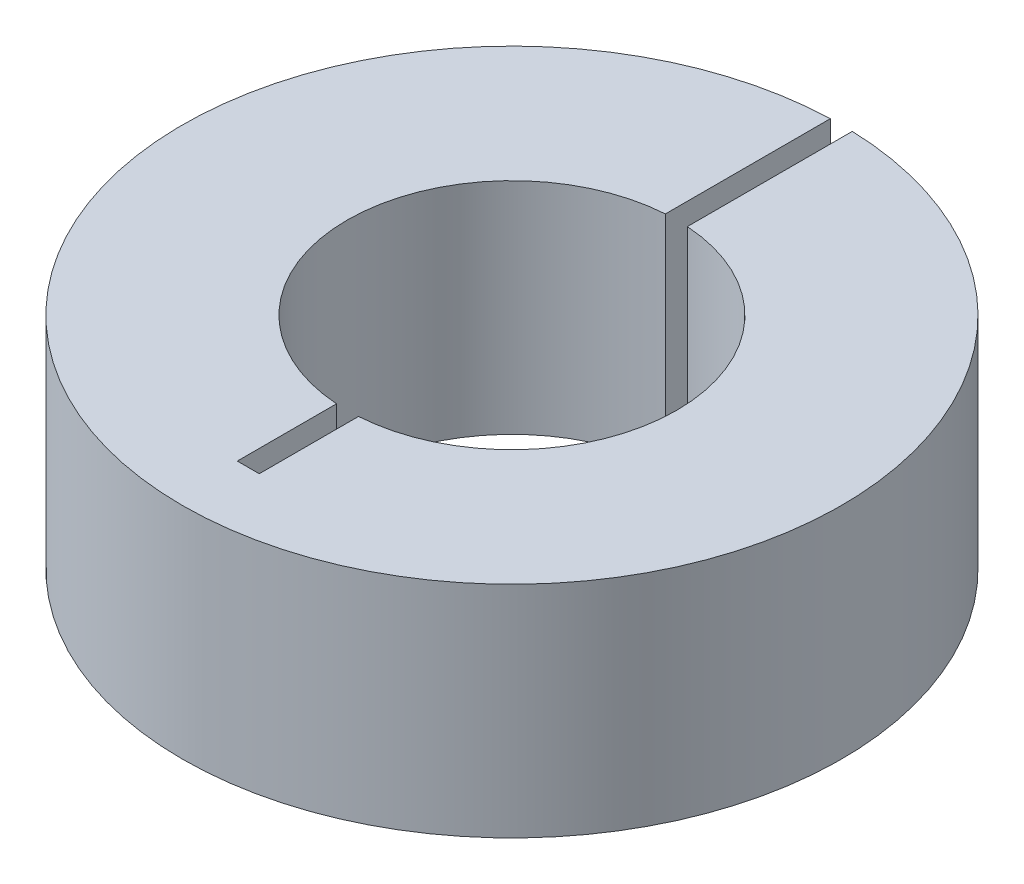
from build123d import *

# Parameters (mm, degrees)
SKETCH1_R          = 19.05
SKETCH1_R_2        = 9.525
EXTRUDE1_DEPTH     = 12.7
SKETCH2_W          = 1.27
SKETCH2_H          = 50.8
CUT_EXTRUDE1_DEPTH = 30.784140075


with BuildPart() as part:
    # Sketch1 → Extrude1 (new body)
    with BuildSketch(Plane(origin=(0, 0, 0), x_dir=(1, 0, 0), z_dir=(0, 1, 0))):
        with Locations(Location((0, 0, 0), (0, 0, 270))):
            Circle(SKETCH1_R)
        with Locations(Location((0, 0, 0), (0, 0, 270))):
            Circle(SKETCH1_R_2, mode=Mode.SUBTRACT)
    extrude(amount=EXTRUDE1_DEPTH)

    # Sketch2 → Cut-Extrude1 (cut, through all)
    with BuildSketch(Plane(origin=(0, 12.7, 0), x_dir=(-1, 0, 0), z_dir=(0, 1, 0))):
        with Locations((0, -10.16)):
            Rectangle(SKETCH2_W, SKETCH2_H)
    extrude(amount=-CUT_EXTRUDE1_DEPTH, mode=Mode.SUBTRACT)


solid = part.part
